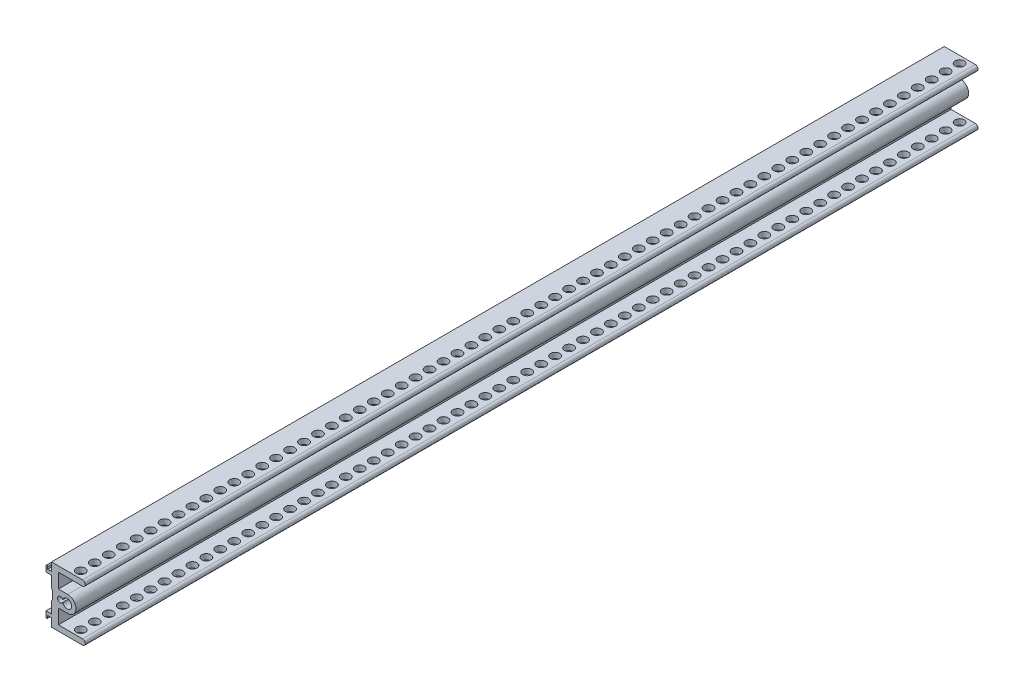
from build123d import *

# Parameters (mm, degrees)
EXTRUDE_1_DEPTH     = 162.56
SKETCH_3_R          = 1.65
CUT_EXTRUDE_1_DEPTH = 2.5


with BuildPart() as part:
    # Sketch 1 → Extrude 1 (new, symmetric)
    with BuildSketch(Plane.XY):
        with BuildLine():
            Line((-4.15, 8.3), (-4.15, 3))
            Line((-4.15, 3), (-0.75, 3))
            ThreePointArc((-0.75, 3), (2.25, 0), (-0.75, -3))
            Line((-0.75, -3), (-4.15, -3))
            Line((-4.15, -3), (-4.15, -8.3))
            Line((-4.15, -8.3), (4.65, -8.3))
            ThreePointArc((4.65, -8.3), (5.65, -9.3), (4.65, -10.3))
            Line((4.65, -10.3), (-6.65, -10.3))
            Line((-6.65, -10.3), (-6.65, -7.3))
            Line((-6.65, -7.3), (-8.05, -7.3))
            Line((-8.05, -7.3), (-8.05, -8.078245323))
            ThreePointArc((-8.05, -8.078245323), (-8.35, -8.378245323), (-8.65, -8.078245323))
            Line((-8.65, -8.078245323), (-8.65, -6.1))
            Line((-8.65, -6.1), (-6.65, -6.1))
            Line((-6.65, -6.1), (-6.65, -2.088438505))
            Line((-6.65, -2.088438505), (-6.35, -1.488438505))
            Line((-6.35, -1.488438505), (-6.35, 1.511561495))
            Line((-6.35, 1.511561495), (-6.65, 2.111561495))
            Line((-6.65, 2.111561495), (-6.65, 6.1))
            Line((-6.65, 6.1), (-8.65, 6.1))
            Line((-8.65, 6.1), (-8.65, 8.078245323))
            ThreePointArc((-8.65, 8.078245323), (-8.35, 8.378245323), (-8.05, 8.078245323))
            Line((-8.05, 8.078245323), (-8.05, 7.3))
            Line((-8.05, 7.3), (-6.65, 7.3))
            Line((-6.65, 7.3), (-6.65, 10.3))
            Line((-6.65, 10.3), (4.65, 10.3))
            ThreePointArc((4.65, 10.3), (5.65, 9.3), (4.65, 8.3))
            Line((4.65, 8.3), (-4.15, 8.3))
        make_face()
        with BuildLine():
            ThreePointArc((-2.5445, -0.424346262), (0.7, 0), (-2.5445, 0.424346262))
            ThreePointArc((-2.5445, 0.424346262), (-4.45, 0), (-2.5445, -0.424346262))
        make_face(mode=Mode.SUBTRACT)
    extrude(amount=EXTRUDE_1_DEPTH, both=True)

    # Sketch 3 → Cut-Extrude 1 (cut)
    with BuildSketch(Plane.XZ.offset(10.3)):
        with Locations((1.5, 160.02)):
            Circle(SKETCH_3_R)
        with Locations((1.5, 154.94)):
            Circle(SKETCH_3_R)
        with Locations((1.5, 149.86)):
            Circle(SKETCH_3_R)
        with Locations((1.5, 144.78)):
            Circle(SKETCH_3_R)
        with Locations((1.5, 139.7)):
            Circle(SKETCH_3_R)
        with Locations((1.5, 134.62)):
            Circle(SKETCH_3_R)
        with Locations((1.5, 129.54)):
            Circle(SKETCH_3_R)
        with Locations((1.5, 124.46)):
            Circle(SKETCH_3_R)
        with Locations((1.5, 119.38)):
            Circle(SKETCH_3_R)
        with Locations((1.5, 114.3)):
            Circle(SKETCH_3_R)
        with Locations((1.5, 109.22)):
            Circle(SKETCH_3_R)
        with Locations((1.5, 104.14)):
            Circle(SKETCH_3_R)
        with Locations((1.5, 99.06)):
            Circle(SKETCH_3_R)
        with Locations((1.5, 93.98)):
            Circle(SKETCH_3_R)
        with Locations((1.5, 88.9)):
            Circle(SKETCH_3_R)
        with Locations((1.5, 83.82)):
            Circle(SKETCH_3_R)
        with Locations((1.5, 78.74)):
            Circle(SKETCH_3_R)
        with Locations((1.5, 73.66)):
            Circle(SKETCH_3_R)
        with Locations((1.5, 68.58)):
            Circle(SKETCH_3_R)
        with Locations((1.5, 63.5)):
            Circle(SKETCH_3_R)
        with Locations((1.5, 58.42)):
            Circle(SKETCH_3_R)
        with Locations((1.5, 53.34)):
            Circle(SKETCH_3_R)
        with Locations((1.5, 48.26)):
            Circle(SKETCH_3_R)
        with Locations((1.5, 43.18)):
            Circle(SKETCH_3_R)
        with Locations((1.5, 38.1)):
            Circle(SKETCH_3_R)
        with Locations((1.5, 33.02)):
            Circle(SKETCH_3_R)
        with Locations((1.5, 27.94)):
            Circle(SKETCH_3_R)
        with Locations((1.5, 22.86)):
            Circle(SKETCH_3_R)
        with Locations((1.5, 17.78)):
            Circle(SKETCH_3_R)
        with Locations((1.5, 12.7)):
            Circle(SKETCH_3_R)
        with Locations((1.5, 7.62)):
            Circle(SKETCH_3_R)
        with Locations((1.5, 2.54)):
            Circle(SKETCH_3_R)
        with Locations((1.5, -2.54)):
            Circle(SKETCH_3_R)
        with Locations((1.5, -7.62)):
            Circle(SKETCH_3_R)
        with Locations((1.5, -12.7)):
            Circle(SKETCH_3_R)
        with Locations((1.5, -17.78)):
            Circle(SKETCH_3_R)
        with Locations((1.5, -22.86)):
            Circle(SKETCH_3_R)
        with Locations((1.5, -27.94)):
            Circle(SKETCH_3_R)
        with Locations((1.5, -33.02)):
            Circle(SKETCH_3_R)
        with Locations((1.5, -38.1)):
            Circle(SKETCH_3_R)
        with Locations((1.5, -43.18)):
            Circle(SKETCH_3_R)
        with Locations((1.5, -48.26)):
            Circle(SKETCH_3_R)
        with Locations((1.5, -53.34)):
            Circle(SKETCH_3_R)
        with Locations((1.5, -58.42)):
            Circle(SKETCH_3_R)
        with Locations((1.5, -63.5)):
            Circle(SKETCH_3_R)
        with Locations((1.5, -68.58)):
            Circle(SKETCH_3_R)
        with Locations((1.5, -73.66)):
            Circle(SKETCH_3_R)
        with Locations((1.5, -78.74)):
            Circle(SKETCH_3_R)
        with Locations((1.5, -83.82)):
            Circle(SKETCH_3_R)
        with Locations((1.5, -88.9)):
            Circle(SKETCH_3_R)
        with Locations((1.5, -93.98)):
            Circle(SKETCH_3_R)
        with Locations((1.5, -99.06)):
            Circle(SKETCH_3_R)
        with Locations((1.5, -104.14)):
            Circle(SKETCH_3_R)
        with Locations((1.5, -109.22)):
            Circle(SKETCH_3_R)
        with Locations((1.5, -114.3)):
            Circle(SKETCH_3_R)
        with Locations((1.5, -119.38)):
            Circle(SKETCH_3_R)
        with Locations((1.5, -124.46)):
            Circle(SKETCH_3_R)
        with Locations((1.5, -129.54)):
            Circle(SKETCH_3_R)
        with Locations((1.5, -134.62)):
            Circle(SKETCH_3_R)
        with Locations((1.5, -139.7)):
            Circle(SKETCH_3_R)
        with Locations((1.5, -144.78)):
            Circle(SKETCH_3_R)
        with Locations((1.5, -149.86)):
            Circle(SKETCH_3_R)
        with Locations((1.5, -154.94)):
            Circle(SKETCH_3_R)
        with Locations((1.5, -160.02)):
            Circle(SKETCH_3_R)
        with Locations((1.5, -165.1)):
            Circle(SKETCH_3_R)
        with Locations((1.5, -170.18)):
            Circle(SKETCH_3_R)
        with Locations((1.5, -175.26)):
            Circle(SKETCH_3_R)
        with Locations((1.5, -180.34)):
            Circle(SKETCH_3_R)
        with Locations((1.5, -185.42)):
            Circle(SKETCH_3_R)
        with Locations((1.5, -190.5)):
            Circle(SKETCH_3_R)
        with Locations((1.5, -195.58)):
            Circle(SKETCH_3_R)
        with Locations((1.5, -200.66)):
            Circle(SKETCH_3_R)
        with Locations((1.5, -205.74)):
            Circle(SKETCH_3_R)
        with Locations((1.5, -210.82)):
            Circle(SKETCH_3_R)
        with Locations((1.5, -215.9)):
            Circle(SKETCH_3_R)
        with Locations((1.5, -220.98)):
            Circle(SKETCH_3_R)
        with Locations((1.5, -226.06)):
            Circle(SKETCH_3_R)
        with Locations((1.5, -231.14)):
            Circle(SKETCH_3_R)
        with Locations((1.5, -236.22)):
            Circle(SKETCH_3_R)
        with Locations((1.5, -241.3)):
            Circle(SKETCH_3_R)
        with Locations((1.5, -246.38)):
            Circle(SKETCH_3_R)
        with Locations((1.5, -251.46)):
            Circle(SKETCH_3_R)
        with Locations((1.5, -256.54)):
            Circle(SKETCH_3_R)
        with Locations((1.5, -261.62)):
            Circle(SKETCH_3_R)
        with Locations((1.5, -266.7)):
            Circle(SKETCH_3_R)
    cut_extrude_1 = extrude(amount=-CUT_EXTRUDE_1_DEPTH, mode=Mode.SUBTRACT)

    # Mirror 1: Cut-Extrude 1 across plane
    add(cut_extrude_1.mirror(Plane.ZX), mode=Mode.SUBTRACT)


solid = part.part
